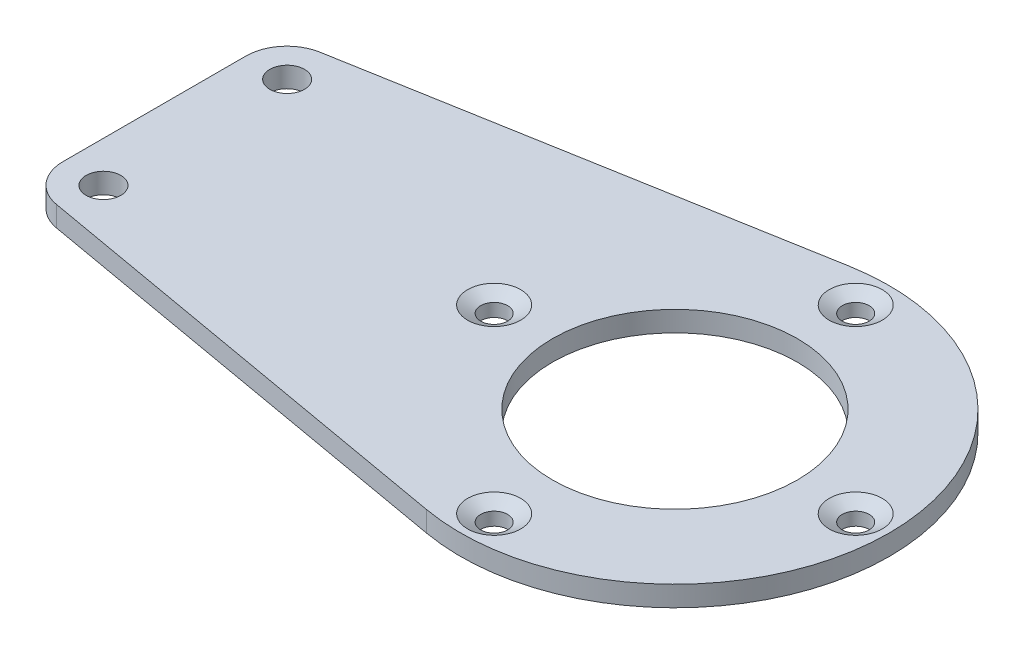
ISO-10303-21;
HEADER;
FILE_DESCRIPTION(('STEP AP214'),'2;1');
FILE_NAME('part.step','',(''),(''),'','','');
FILE_SCHEMA(('AUTOMOTIVE_DESIGN { 1 0 10303 214 1 1 1 1 }'));
ENDSEC;
DATA;
#1=APPLICATION_CONTEXT('core data for automotive mechanical design processes');
#2=APPLICATION_PROTOCOL_DEFINITION('international standard','automotive_design',2000,#1);
#3=PRODUCT_CONTEXT('',#1,'mechanical');
#4=PRODUCT('Part','Part','',(#3));
#5=PRODUCT_RELATED_PRODUCT_CATEGORY('part','',(#4));
#6=PRODUCT_DEFINITION_FORMATION('','',#4);
#7=PRODUCT_DEFINITION_CONTEXT('part definition',#1,'design');
#8=PRODUCT_DEFINITION('design','',#6,#7);
#9=PRODUCT_DEFINITION_SHAPE('','',#8);
#10=(LENGTH_UNIT() NAMED_UNIT(*) SI_UNIT(.MILLI.,.METRE.));
#11=(NAMED_UNIT(*) PLANE_ANGLE_UNIT() SI_UNIT($,.RADIAN.));
#12=(NAMED_UNIT(*) SI_UNIT($,.STERADIAN.) SOLID_ANGLE_UNIT());
#13=UNCERTAINTY_MEASURE_WITH_UNIT(LENGTH_MEASURE(1.E-05),#10,'distance_accuracy_value','');
#14=(GEOMETRIC_REPRESENTATION_CONTEXT(3) GLOBAL_UNCERTAINTY_ASSIGNED_CONTEXT((#13)) GLOBAL_UNIT_ASSIGNED_CONTEXT((#10,
#11,#12)) REPRESENTATION_CONTEXT('',''));
#15=CARTESIAN_POINT('',(0.,0.,0.));
#16=DIRECTION('',(0.,0.,1.));
#17=DIRECTION('',(1.,0.,0.));
#18=AXIS2_PLACEMENT_3D('',#15,#16,#17);
#19=CARTESIAN_POINT('',(0.,1.87583282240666E-09,-44.285));
#20=DIRECTION('',(0.,1.,0.));
#21=DIRECTION('',(0.,0.,1.));
#22=AXIS2_PLACEMENT_3D('',#19,#20,#21);
#23=CONICAL_SURFACE('',#22,6.49999999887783,1.05840686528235);
#24=CARTESIAN_POINT('',(0.,1.87583282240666E-09,-44.285));
#25=DIRECTION('',(0.,1.,0.));
#26=DIRECTION('',(0.,0.,1.));
#27=AXIS2_PLACEMENT_3D('',#24,#25,#26);
#28=CIRCLE('',#27,6.49999999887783);
#29=CARTESIAN_POINT('',(0.,1.87583282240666E-09,-37.7850000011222));
#30=VERTEX_POINT('',#29);
#31=EDGE_CURVE('E18',#30,#30,#28,.T.);
#32=ORIENTED_EDGE('',*,*,#31,.T.);
#33=EDGE_LOOP('',(#32));
#34=FACE_BOUND('',#33,.T.);
#35=CARTESIAN_POINT('',(0.,-1.80000000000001,-44.285));
#36=DIRECTION('',(0.,-1.,0.));
#37=DIRECTION('',(0.,0.,-1.));
#38=AXIS2_PLACEMENT_3D('',#35,#36,#37);
#39=CIRCLE('',#38,3.3);
#40=CARTESIAN_POINT('',(0.,-1.80000000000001,-47.585));
#41=VERTEX_POINT('',#40);
#42=EDGE_CURVE('E313',#41,#41,#39,.T.);
#43=ORIENTED_EDGE('',*,*,#42,.T.);
#44=EDGE_LOOP('',(#43));
#45=FACE_BOUND('',#44,.T.);
#46=ADVANCED_FACE('F15',(#34,#45),#23,.F.);
#47=CARTESIAN_POINT('',(44.285,1.87583282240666E-09,0.));
#48=DIRECTION('',(0.,1.,0.));
#49=DIRECTION('',(0.,0.,1.));
#50=AXIS2_PLACEMENT_3D('',#47,#48,#49);
#51=CONICAL_SURFACE('',#50,6.49999999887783,1.05840686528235);
#52=CARTESIAN_POINT('',(44.285,1.87583282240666E-09,0.));
#53=DIRECTION('',(0.,1.,0.));
#54=DIRECTION('',(0.,0.,1.));
#55=AXIS2_PLACEMENT_3D('',#52,#53,#54);
#56=CIRCLE('',#55,6.49999999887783);
#57=CARTESIAN_POINT('',(44.285,1.87583282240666E-09,6.49999999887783));
#58=VERTEX_POINT('',#57);
#59=EDGE_CURVE('E148',#58,#58,#56,.T.);
#60=ORIENTED_EDGE('',*,*,#59,.T.);
#61=EDGE_LOOP('',(#60));
#62=FACE_BOUND('',#61,.T.);
#63=CARTESIAN_POINT('',(44.285,-1.8,0.));
#64=DIRECTION('',(0.,-1.,0.));
#65=DIRECTION('',(0.,0.,-1.));
#66=AXIS2_PLACEMENT_3D('',#63,#64,#65);
#67=CIRCLE('',#66,3.3);
#68=CARTESIAN_POINT('',(44.285,-1.8,-3.29999999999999));
#69=VERTEX_POINT('',#68);
#70=EDGE_CURVE('E311',#69,#69,#67,.T.);
#71=ORIENTED_EDGE('',*,*,#70,.T.);
#72=EDGE_LOOP('',(#71));
#73=FACE_BOUND('',#72,.T.);
#74=ADVANCED_FACE('F294',(#62,#73),#51,.F.);
#75=CARTESIAN_POINT('',(0.,1.87583282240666E-09,44.285));
#76=DIRECTION('',(0.,1.,0.));
#77=DIRECTION('',(0.,0.,1.));
#78=AXIS2_PLACEMENT_3D('',#75,#76,#77);
#79=CONICAL_SURFACE('',#78,6.49999999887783,1.05840686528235);
#80=CARTESIAN_POINT('',(0.,1.87583282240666E-09,44.285));
#81=DIRECTION('',(0.,1.,0.));
#82=DIRECTION('',(0.,0.,1.));
#83=AXIS2_PLACEMENT_3D('',#80,#81,#82);
#84=CIRCLE('',#83,6.49999999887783);
#85=CARTESIAN_POINT('',(0.,1.87583282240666E-09,50.7849999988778));
#86=VERTEX_POINT('',#85);
#87=EDGE_CURVE('E146',#86,#86,#84,.T.);
#88=ORIENTED_EDGE('',*,*,#87,.T.);
#89=EDGE_LOOP('',(#88));
#90=FACE_BOUND('',#89,.T.);
#91=CARTESIAN_POINT('',(0.,-1.79999999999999,44.285));
#92=DIRECTION('',(0.,-1.,0.));
#93=DIRECTION('',(0.,0.,-1.));
#94=AXIS2_PLACEMENT_3D('',#91,#92,#93);
#95=CIRCLE('',#94,3.3);
#96=CARTESIAN_POINT('',(0.,-1.79999999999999,40.985));
#97=VERTEX_POINT('',#96);
#98=EDGE_CURVE('E312',#97,#97,#95,.T.);
#99=ORIENTED_EDGE('',*,*,#98,.T.);
#100=EDGE_LOOP('',(#99));
#101=FACE_BOUND('',#100,.T.);
#102=ADVANCED_FACE('F168',(#90,#101),#79,.F.);
#103=CARTESIAN_POINT('',(-44.285,1.87583282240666E-09,0.));
#104=DIRECTION('',(0.,1.,0.));
#105=DIRECTION('',(0.,0.,1.));
#106=AXIS2_PLACEMENT_3D('',#103,#104,#105);
#107=CONICAL_SURFACE('',#106,6.49999999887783,1.05840686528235);
#108=CARTESIAN_POINT('',(-44.285,1.87583282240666E-09,0.));
#109=DIRECTION('',(0.,1.,0.));
#110=DIRECTION('',(0.,0.,1.));
#111=AXIS2_PLACEMENT_3D('',#108,#109,#110);
#112=CIRCLE('',#111,6.49999999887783);
#113=CARTESIAN_POINT('',(-44.285,1.87583282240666E-09,6.49999999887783));
#114=VERTEX_POINT('',#113);
#115=EDGE_CURVE('E98',#114,#114,#112,.T.);
#116=ORIENTED_EDGE('',*,*,#115,.T.);
#117=EDGE_LOOP('',(#116));
#118=FACE_BOUND('',#117,.T.);
#119=CARTESIAN_POINT('',(-44.285,-1.8,0.));
#120=DIRECTION('',(0.,-1.,0.));
#121=DIRECTION('',(0.,0.,-1.));
#122=AXIS2_PLACEMENT_3D('',#119,#120,#121);
#123=CIRCLE('',#122,3.3);
#124=CARTESIAN_POINT('',(-44.285,-1.8,-3.3));
#125=VERTEX_POINT('',#124);
#126=EDGE_CURVE('E138',#125,#125,#123,.T.);
#127=ORIENTED_EDGE('',*,*,#126,.T.);
#128=EDGE_LOOP('',(#127));
#129=FACE_BOUND('',#128,.T.);
#130=ADVANCED_FACE('F159',(#118,#129),#107,.F.);
#131=CARTESIAN_POINT('',(-39.2237538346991,0.,0.));
#132=DIRECTION('',(0.,-1.,0.));
#133=DIRECTION('',(0.,0.,-1.));
#134=AXIS2_PLACEMENT_3D('',#131,#132,#133);
#135=PLANE('',#134);
#136=CARTESIAN_POINT('',(0.,0.,0.));
#137=DIRECTION('',(0.,1.,0.));
#138=DIRECTION('',(0.,0.,1.));
#139=AXIS2_PLACEMENT_3D('',#136,#137,#138);
#140=CIRCLE('',#139,30.);
#141=CARTESIAN_POINT('',(0.,0.,30.));
#142=VERTEX_POINT('',#141);
#143=EDGE_CURVE('E129',#142,#142,#140,.F.);
#144=ORIENTED_EDGE('',*,*,#143,.T.);
#145=EDGE_LOOP('',(#144));
#146=FACE_BOUND('',#145,.T.);
#147=CARTESIAN_POINT('',(-117.5,0.,-22.5));
#148=DIRECTION('',(0.,1.,0.));
#149=DIRECTION('',(0.,0.,1.));
#150=AXIS2_PLACEMENT_3D('',#147,#148,#149);
#151=CIRCLE('',#150,4.25);
#152=CARTESIAN_POINT('',(-117.5,0.,-18.25));
#153=VERTEX_POINT('',#152);
#154=EDGE_CURVE('E132',#153,#153,#151,.F.);
#155=ORIENTED_EDGE('',*,*,#154,.T.);
#156=EDGE_LOOP('',(#155));
#157=FACE_BOUND('',#156,.T.);
#158=CARTESIAN_POINT('',(-117.5,0.,22.5));
#159=DIRECTION('',(0.,1.,0.));
#160=DIRECTION('',(0.,0.,1.));
#161=AXIS2_PLACEMENT_3D('',#158,#159,#160);
#162=CIRCLE('',#161,4.25);
#163=CARTESIAN_POINT('',(-117.5,0.,26.75));
#164=VERTEX_POINT('',#163);
#165=EDGE_CURVE('E135',#164,#164,#162,.F.);
#166=ORIENTED_EDGE('',*,*,#165,.T.);
#167=EDGE_LOOP('',(#166));
#168=FACE_BOUND('',#167,.T.);
#169=ORIENTED_EDGE('',*,*,#115,.F.);
#170=EDGE_LOOP('',(#169));
#171=FACE_BOUND('',#170,.T.);
#172=ORIENTED_EDGE('',*,*,#87,.F.);
#173=EDGE_LOOP('',(#172));
#174=FACE_BOUND('',#173,.T.);
#175=ORIENTED_EDGE('',*,*,#59,.F.);
#176=EDGE_LOOP('',(#175));
#177=FACE_BOUND('',#176,.T.);
#178=ORIENTED_EDGE('',*,*,#31,.F.);
#179=EDGE_LOOP('',(#178));
#180=FACE_BOUND('',#179,.T.);
#181=DIRECTION('',(-0.984807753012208,0.,0.173648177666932));
#182=VECTOR('',#181,1.);
#183=CARTESIAN_POINT('',(-9.11652932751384,0.,-51.7024070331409));
#184=LINE('',#183,#182);
#185=CARTESIAN_POINT('',(-119.236481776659,0.,-32.2852883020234));
#186=VERTEX_POINT('',#185);
#187=CARTESIAN_POINT('',(-9.11652932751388,0.,-51.7024070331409));
#188=VERTEX_POINT('',#187);
#189=EDGE_CURVE('E64',#186,#188,#184,.F.);
#190=ORIENTED_EDGE('',*,*,#189,.F.);
#191=CARTESIAN_POINT('',(-117.49999999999,0.,-22.4372107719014));
#192=DIRECTION('',(0.,-1.,0.));
#193=DIRECTION('',(0.,0.,-1.));
#194=AXIS2_PLACEMENT_3D('',#191,#192,#193);
#195=CIRCLE('',#194,9.99999999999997);
#196=CARTESIAN_POINT('',(-127.49999999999,0.,-22.4372107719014));
#197=VERTEX_POINT('',#196);
#198=EDGE_CURVE('E139',#197,#186,#195,.T.);
#199=ORIENTED_EDGE('',*,*,#198,.F.);
#200=DIRECTION('',(0.,0.,1.));
#201=VECTOR('',#200,1.);
#202=CARTESIAN_POINT('',(-127.49999999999,0.,-22.4372107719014));
#203=LINE('',#202,#201);
#204=CARTESIAN_POINT('',(-127.49999999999,0.,22.4372107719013));
#205=VERTEX_POINT('',#204);
#206=EDGE_CURVE('E99',#205,#197,#203,.F.);
#207=ORIENTED_EDGE('',*,*,#206,.F.);
#208=CARTESIAN_POINT('',(-117.49999999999,0.,22.4372107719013));
#209=DIRECTION('',(0.,-1.,0.));
#210=DIRECTION('',(0.,0.,-1.));
#211=AXIS2_PLACEMENT_3D('',#208,#209,#210);
#212=CIRCLE('',#211,10.);
#213=CARTESIAN_POINT('',(-119.236481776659,0.,32.2852883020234));
#214=VERTEX_POINT('',#213);
#215=EDGE_CURVE('E83',#214,#205,#212,.T.);
#216=ORIENTED_EDGE('',*,*,#215,.F.);
#217=DIRECTION('',(0.984807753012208,0.,0.173648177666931));
#218=VECTOR('',#217,1.);
#219=CARTESIAN_POINT('',(-119.236481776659,0.,32.2852883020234));
#220=LINE('',#219,#218);
#221=CARTESIAN_POINT('',(-9.11652932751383,0.,51.7024070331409));
#222=VERTEX_POINT('',#221);
#223=EDGE_CURVE('E80',#222,#214,#220,.F.);
#224=ORIENTED_EDGE('',*,*,#223,.F.);
#225=CARTESIAN_POINT('',(0.,0.,0.));
#226=DIRECTION('',(0.,-1.,0.));
#227=DIRECTION('',(0.,0.,-1.));
#228=AXIS2_PLACEMENT_3D('',#225,#226,#227);
#229=CIRCLE('',#228,52.5);
#230=EDGE_CURVE('E69',#188,#222,#229,.T.);
#231=ORIENTED_EDGE('',*,*,#230,.F.);
#232=EDGE_LOOP('',(#190,#199,#207,#216,#224,#231));
#233=FACE_BOUND('',#232,.T.);
#234=ADVANCED_FACE('F81',(#146,#157,#168,#171,#174,#177,#180,#233),#135,.F.);
#235=CARTESIAN_POINT('',(-9.11652932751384,0.,-51.7024070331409));
#236=DIRECTION('',(-0.173648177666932,0.,-0.984807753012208));
#237=DIRECTION('',(-0.984807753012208,0.,0.173648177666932));
#238=AXIS2_PLACEMENT_3D('',#235,#236,#237);
#239=PLANE('',#238);
#240=ORIENTED_EDGE('',*,*,#189,.T.);
#241=DIRECTION('',(0.,-1.,0.));
#242=VECTOR('',#241,1.);
#243=CARTESIAN_POINT('',(-9.11652932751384,0.,-51.7024070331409));
#244=LINE('',#243,#242);
#245=CARTESIAN_POINT('',(-9.11652932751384,-5.,-51.7024070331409));
#246=VERTEX_POINT('',#245);
#247=EDGE_CURVE('E76',#246,#188,#244,.F.);
#248=ORIENTED_EDGE('',*,*,#247,.F.);
#249=DIRECTION('',(0.984807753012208,0.,-0.17364817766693));
#250=VECTOR('',#249,1.);
#251=CARTESIAN_POINT('',(-119.236481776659,-5.,-32.2852883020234));
#252=LINE('',#251,#250);
#253=CARTESIAN_POINT('',(-119.236481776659,-5.,-32.2852883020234));
#254=VERTEX_POINT('',#253);
#255=EDGE_CURVE('E128',#254,#246,#252,.T.);
#256=ORIENTED_EDGE('',*,*,#255,.F.);
#257=DIRECTION('',(0.,-1.,0.));
#258=VECTOR('',#257,1.);
#259=CARTESIAN_POINT('',(-119.236481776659,0.,-32.2852883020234));
#260=LINE('',#259,#258);
#261=EDGE_CURVE('E142',#186,#254,#260,.T.);
#262=ORIENTED_EDGE('',*,*,#261,.F.);
#263=EDGE_LOOP('',(#240,#248,#256,#262));
#264=FACE_BOUND('',#263,.T.);
#265=ADVANCED_FACE('F158',(#264),#239,.T.);
#266=CARTESIAN_POINT('',(0.,0.,0.));
#267=DIRECTION('',(0.,-1.,0.));
#268=DIRECTION('',(0.,0.,-1.));
#269=AXIS2_PLACEMENT_3D('',#266,#267,#268);
#270=CYLINDRICAL_SURFACE('',#269,52.5);
#271=ORIENTED_EDGE('',*,*,#230,.T.);
#272=DIRECTION('',(0.,1.,0.));
#273=VECTOR('',#272,1.);
#274=CARTESIAN_POINT('',(-9.11652932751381,0.,51.7024070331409));
#275=LINE('',#274,#273);
#276=CARTESIAN_POINT('',(-9.11652932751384,-5.,51.7024070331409));
#277=VERTEX_POINT('',#276);
#278=EDGE_CURVE('E74',#277,#222,#275,.T.);
#279=ORIENTED_EDGE('',*,*,#278,.F.);
#280=CARTESIAN_POINT('',(0.,-5.,0.));
#281=DIRECTION('',(0.,-1.,0.));
#282=DIRECTION('',(0.,0.,-1.));
#283=AXIS2_PLACEMENT_3D('',#280,#281,#282);
#284=CIRCLE('',#283,52.5);
#285=EDGE_CURVE('E126',#246,#277,#284,.T.);
#286=ORIENTED_EDGE('',*,*,#285,.F.);
#287=ORIENTED_EDGE('',*,*,#247,.T.);
#288=EDGE_LOOP('',(#271,#279,#286,#287));
#289=FACE_BOUND('',#288,.T.);
#290=ADVANCED_FACE('F71',(#289),#270,.T.);
#291=CARTESIAN_POINT('',(-119.236481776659,0.,32.2852883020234));
#292=DIRECTION('',(-0.173648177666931,0.,0.984807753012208));
#293=DIRECTION('',(0.984807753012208,0.,0.173648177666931));
#294=AXIS2_PLACEMENT_3D('',#291,#292,#293);
#295=PLANE('',#294);
#296=ORIENTED_EDGE('',*,*,#223,.T.);
#297=DIRECTION('',(0.,-1.,0.));
#298=VECTOR('',#297,1.);
#299=CARTESIAN_POINT('',(-119.236481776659,0.,32.2852883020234));
#300=LINE('',#299,#298);
#301=CARTESIAN_POINT('',(-119.236481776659,-5.,32.2852883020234));
#302=VERTEX_POINT('',#301);
#303=EDGE_CURVE('E86',#302,#214,#300,.F.);
#304=ORIENTED_EDGE('',*,*,#303,.F.);
#305=DIRECTION('',(-0.984807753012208,0.,-0.173648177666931));
#306=VECTOR('',#305,1.);
#307=CARTESIAN_POINT('',(-9.11652932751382,-5.,51.702407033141));
#308=LINE('',#307,#306);
#309=EDGE_CURVE('E90',#277,#302,#308,.T.);
#310=ORIENTED_EDGE('',*,*,#309,.F.);
#311=ORIENTED_EDGE('',*,*,#278,.T.);
#312=EDGE_LOOP('',(#296,#304,#310,#311));
#313=FACE_BOUND('',#312,.T.);
#314=ADVANCED_FACE('F88',(#313),#295,.T.);
#315=CARTESIAN_POINT('',(-117.49999999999,0.,22.4372107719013));
#316=DIRECTION('',(0.,-1.,0.));
#317=DIRECTION('',(0.,0.,-1.));
#318=AXIS2_PLACEMENT_3D('',#315,#316,#317);
#319=CYLINDRICAL_SURFACE('',#318,10.);
#320=ORIENTED_EDGE('',*,*,#215,.T.);
#321=DIRECTION('',(0.,1.,0.));
#322=VECTOR('',#321,1.);
#323=CARTESIAN_POINT('',(-127.49999999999,0.,22.4372107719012));
#324=LINE('',#323,#322);
#325=CARTESIAN_POINT('',(-127.49999999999,-5.,22.4372107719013));
#326=VERTEX_POINT('',#325);
#327=EDGE_CURVE('E100',#326,#205,#324,.T.);
#328=ORIENTED_EDGE('',*,*,#327,.F.);
#329=CARTESIAN_POINT('',(-117.49999999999,-5.,22.4372107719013));
#330=DIRECTION('',(0.,-1.,0.));
#331=DIRECTION('',(0.,0.,-1.));
#332=AXIS2_PLACEMENT_3D('',#329,#330,#331);
#333=CIRCLE('',#332,10.);
#334=EDGE_CURVE('E123',#302,#326,#333,.T.);
#335=ORIENTED_EDGE('',*,*,#334,.F.);
#336=ORIENTED_EDGE('',*,*,#303,.T.);
#337=EDGE_LOOP('',(#320,#328,#335,#336));
#338=FACE_BOUND('',#337,.T.);
#339=ADVANCED_FACE('F213',(#338),#319,.T.);
#340=CARTESIAN_POINT('',(-127.49999999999,0.,-22.4372107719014));
#341=DIRECTION('',(-1.,0.,0.));
#342=DIRECTION('',(0.,0.,1.));
#343=AXIS2_PLACEMENT_3D('',#340,#341,#342);
#344=PLANE('',#343);
#345=ORIENTED_EDGE('',*,*,#206,.T.);
#346=DIRECTION('',(0.,-1.,0.));
#347=VECTOR('',#346,1.);
#348=CARTESIAN_POINT('',(-127.49999999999,0.,-22.4372107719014));
#349=LINE('',#348,#347);
#350=CARTESIAN_POINT('',(-127.49999999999,-5.,-22.4372107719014));
#351=VERTEX_POINT('',#350);
#352=EDGE_CURVE('E33',#351,#197,#349,.F.);
#353=ORIENTED_EDGE('',*,*,#352,.F.);
#354=DIRECTION('',(0.,0.,-1.));
#355=VECTOR('',#354,1.);
#356=CARTESIAN_POINT('',(-127.49999999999,-5.,0.));
#357=LINE('',#356,#355);
#358=EDGE_CURVE('E122',#326,#351,#357,.T.);
#359=ORIENTED_EDGE('',*,*,#358,.F.);
#360=ORIENTED_EDGE('',*,*,#327,.T.);
#361=EDGE_LOOP('',(#345,#353,#359,#360));
#362=FACE_BOUND('',#361,.T.);
#363=ADVANCED_FACE('F209',(#362),#344,.T.);
#364=CARTESIAN_POINT('',(-117.49999999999,0.,-22.4372107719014));
#365=DIRECTION('',(0.,-1.,0.));
#366=DIRECTION('',(0.,0.,-1.));
#367=AXIS2_PLACEMENT_3D('',#364,#365,#366);
#368=CYLINDRICAL_SURFACE('',#367,9.99999999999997);
#369=ORIENTED_EDGE('',*,*,#198,.T.);
#370=ORIENTED_EDGE('',*,*,#261,.T.);
#371=CARTESIAN_POINT('',(-117.49999999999,-5.,-22.4372107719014));
#372=DIRECTION('',(0.,-1.,0.));
#373=DIRECTION('',(0.,0.,-1.));
#374=AXIS2_PLACEMENT_3D('',#371,#372,#373);
#375=CIRCLE('',#374,9.99999999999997);
#376=EDGE_CURVE('E119',#351,#254,#375,.T.);
#377=ORIENTED_EDGE('',*,*,#376,.F.);
#378=ORIENTED_EDGE('',*,*,#352,.T.);
#379=EDGE_LOOP('',(#369,#370,#377,#378));
#380=FACE_BOUND('',#379,.T.);
#381=ADVANCED_FACE('F205',(#380),#368,.T.);
#382=CARTESIAN_POINT('',(0.,-3.40000000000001,-44.285));
#383=DIRECTION('',(0.,-1.,0.));
#384=DIRECTION('',(0.,0.,-1.));
#385=AXIS2_PLACEMENT_3D('',#382,#383,#384);
#386=CYLINDRICAL_SURFACE('',#385,3.3);
#387=ORIENTED_EDGE('',*,*,#42,.F.);
#388=EDGE_LOOP('',(#387));
#389=FACE_BOUND('',#388,.T.);
#390=CARTESIAN_POINT('',(0.,-5.00000000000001,-44.285));
#391=DIRECTION('',(0.,-1.,0.));
#392=DIRECTION('',(0.,0.,-1.));
#393=AXIS2_PLACEMENT_3D('',#390,#391,#392);
#394=CIRCLE('',#393,3.3);
#395=CARTESIAN_POINT('',(0.,-5.00000000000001,-47.585));
#396=VERTEX_POINT('',#395);
#397=EDGE_CURVE('E116',#396,#396,#394,.F.);
#398=ORIENTED_EDGE('',*,*,#397,.F.);
#399=EDGE_LOOP('',(#398));
#400=FACE_BOUND('',#399,.T.);
#401=ADVANCED_FACE('F201',(#389,#400),#386,.F.);
#402=CARTESIAN_POINT('',(44.285,-3.4,0.));
#403=DIRECTION('',(0.,-1.,0.));
#404=DIRECTION('',(0.,0.,-1.));
#405=AXIS2_PLACEMENT_3D('',#402,#403,#404);
#406=CYLINDRICAL_SURFACE('',#405,3.3);
#407=ORIENTED_EDGE('',*,*,#70,.F.);
#408=EDGE_LOOP('',(#407));
#409=FACE_BOUND('',#408,.T.);
#410=CARTESIAN_POINT('',(44.285,-5.,0.));
#411=DIRECTION('',(0.,-1.,0.));
#412=DIRECTION('',(0.,0.,-1.));
#413=AXIS2_PLACEMENT_3D('',#410,#411,#412);
#414=CIRCLE('',#413,3.3);
#415=CARTESIAN_POINT('',(44.285,-5.,-3.29999999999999));
#416=VERTEX_POINT('',#415);
#417=EDGE_CURVE('E113',#416,#416,#414,.F.);
#418=ORIENTED_EDGE('',*,*,#417,.F.);
#419=EDGE_LOOP('',(#418));
#420=FACE_BOUND('',#419,.T.);
#421=ADVANCED_FACE('F197',(#409,#420),#406,.F.);
#422=CARTESIAN_POINT('',(0.,-3.39999999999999,44.285));
#423=DIRECTION('',(0.,-1.,0.));
#424=DIRECTION('',(0.,0.,-1.));
#425=AXIS2_PLACEMENT_3D('',#422,#423,#424);
#426=CYLINDRICAL_SURFACE('',#425,3.3);
#427=ORIENTED_EDGE('',*,*,#98,.F.);
#428=EDGE_LOOP('',(#427));
#429=FACE_BOUND('',#428,.T.);
#430=CARTESIAN_POINT('',(0.,-4.99999999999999,44.285));
#431=DIRECTION('',(0.,-1.,0.));
#432=DIRECTION('',(0.,0.,-1.));
#433=AXIS2_PLACEMENT_3D('',#430,#431,#432);
#434=CIRCLE('',#433,3.3);
#435=CARTESIAN_POINT('',(0.,-4.99999999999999,40.985));
#436=VERTEX_POINT('',#435);
#437=EDGE_CURVE('E110',#436,#436,#434,.F.);
#438=ORIENTED_EDGE('',*,*,#437,.F.);
#439=EDGE_LOOP('',(#438));
#440=FACE_BOUND('',#439,.T.);
#441=ADVANCED_FACE('F193',(#429,#440),#426,.F.);
#442=CARTESIAN_POINT('',(-44.285,-3.4,0.));
#443=DIRECTION('',(0.,-1.,0.));
#444=DIRECTION('',(0.,0.,-1.));
#445=AXIS2_PLACEMENT_3D('',#442,#443,#444);
#446=CYLINDRICAL_SURFACE('',#445,3.3);
#447=ORIENTED_EDGE('',*,*,#126,.F.);
#448=EDGE_LOOP('',(#447));
#449=FACE_BOUND('',#448,.T.);
#450=CARTESIAN_POINT('',(-44.285,-5.,0.));
#451=DIRECTION('',(0.,-1.,0.));
#452=DIRECTION('',(0.,0.,-1.));
#453=AXIS2_PLACEMENT_3D('',#450,#451,#452);
#454=CIRCLE('',#453,3.3);
#455=CARTESIAN_POINT('',(-44.285,-5.,-3.3));
#456=VERTEX_POINT('',#455);
#457=EDGE_CURVE('E107',#456,#456,#454,.F.);
#458=ORIENTED_EDGE('',*,*,#457,.F.);
#459=EDGE_LOOP('',(#458));
#460=FACE_BOUND('',#459,.T.);
#461=ADVANCED_FACE('F189',(#449,#460),#446,.F.);
#462=CARTESIAN_POINT('',(-117.5,-2.5,22.5));
#463=DIRECTION('',(0.,1.,0.));
#464=DIRECTION('',(0.,0.,1.));
#465=AXIS2_PLACEMENT_3D('',#462,#463,#464);
#466=CYLINDRICAL_SURFACE('',#465,4.25);
#467=CARTESIAN_POINT('',(-117.5,-5.,22.5));
#468=DIRECTION('',(0.,1.,0.));
#469=DIRECTION('',(0.,0.,1.));
#470=AXIS2_PLACEMENT_3D('',#467,#468,#469);
#471=CIRCLE('',#470,4.25);
#472=CARTESIAN_POINT('',(-117.5,-5.,26.75));
#473=VERTEX_POINT('',#472);
#474=EDGE_CURVE('E104',#473,#473,#471,.T.);
#475=ORIENTED_EDGE('',*,*,#474,.F.);
#476=EDGE_LOOP('',(#475));
#477=FACE_BOUND('',#476,.T.);
#478=ORIENTED_EDGE('',*,*,#165,.F.);
#479=EDGE_LOOP('',(#478));
#480=FACE_BOUND('',#479,.T.);
#481=ADVANCED_FACE('F185',(#477,#480),#466,.F.);
#482=CARTESIAN_POINT('',(-117.5,-2.5,-22.5));
#483=DIRECTION('',(0.,1.,0.));
#484=DIRECTION('',(0.,0.,1.));
#485=AXIS2_PLACEMENT_3D('',#482,#483,#484);
#486=CYLINDRICAL_SURFACE('',#485,4.25);
#487=CARTESIAN_POINT('',(-117.5,-5.,-22.5));
#488=DIRECTION('',(0.,1.,0.));
#489=DIRECTION('',(0.,0.,1.));
#490=AXIS2_PLACEMENT_3D('',#487,#488,#489);
#491=CIRCLE('',#490,4.25);
#492=CARTESIAN_POINT('',(-117.5,-5.,-18.25));
#493=VERTEX_POINT('',#492);
#494=EDGE_CURVE('E24',#493,#493,#491,.T.);
#495=ORIENTED_EDGE('',*,*,#494,.F.);
#496=EDGE_LOOP('',(#495));
#497=FACE_BOUND('',#496,.T.);
#498=ORIENTED_EDGE('',*,*,#154,.F.);
#499=EDGE_LOOP('',(#498));
#500=FACE_BOUND('',#499,.T.);
#501=ADVANCED_FACE('F178',(#497,#500),#486,.F.);
#502=CARTESIAN_POINT('',(0.,-2.5,0.));
#503=DIRECTION('',(0.,1.,0.));
#504=DIRECTION('',(0.,0.,1.));
#505=AXIS2_PLACEMENT_3D('',#502,#503,#504);
#506=CYLINDRICAL_SURFACE('',#505,30.);
#507=CARTESIAN_POINT('',(0.,-5.,0.));
#508=DIRECTION('',(0.,1.,0.));
#509=DIRECTION('',(0.,0.,1.));
#510=AXIS2_PLACEMENT_3D('',#507,#508,#509);
#511=CIRCLE('',#510,30.);
#512=CARTESIAN_POINT('',(0.,-5.,30.));
#513=VERTEX_POINT('',#512);
#514=EDGE_CURVE('E10',#513,#513,#511,.T.);
#515=ORIENTED_EDGE('',*,*,#514,.F.);
#516=EDGE_LOOP('',(#515));
#517=FACE_BOUND('',#516,.T.);
#518=ORIENTED_EDGE('',*,*,#143,.F.);
#519=EDGE_LOOP('',(#518));
#520=FACE_BOUND('',#519,.T.);
#521=ADVANCED_FACE('F173',(#517,#520),#506,.F.);
#522=CARTESIAN_POINT('',(-39.2237538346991,-5.,0.));
#523=DIRECTION('',(0.,-1.,0.));
#524=DIRECTION('',(0.,0.,-1.));
#525=AXIS2_PLACEMENT_3D('',#522,#523,#524);
#526=PLANE('',#525);
#527=ORIENTED_EDGE('',*,*,#514,.T.);
#528=EDGE_LOOP('',(#527));
#529=FACE_BOUND('',#528,.T.);
#530=ORIENTED_EDGE('',*,*,#494,.T.);
#531=EDGE_LOOP('',(#530));
#532=FACE_BOUND('',#531,.T.);
#533=ORIENTED_EDGE('',*,*,#474,.T.);
#534=EDGE_LOOP('',(#533));
#535=FACE_BOUND('',#534,.T.);
#536=ORIENTED_EDGE('',*,*,#457,.T.);
#537=EDGE_LOOP('',(#536));
#538=FACE_BOUND('',#537,.T.);
#539=ORIENTED_EDGE('',*,*,#437,.T.);
#540=EDGE_LOOP('',(#539));
#541=FACE_BOUND('',#540,.T.);
#542=ORIENTED_EDGE('',*,*,#417,.T.);
#543=EDGE_LOOP('',(#542));
#544=FACE_BOUND('',#543,.T.);
#545=ORIENTED_EDGE('',*,*,#397,.T.);
#546=EDGE_LOOP('',(#545));
#547=FACE_BOUND('',#546,.T.);
#548=ORIENTED_EDGE('',*,*,#358,.T.);
#549=ORIENTED_EDGE('',*,*,#376,.T.);
#550=ORIENTED_EDGE('',*,*,#255,.T.);
#551=ORIENTED_EDGE('',*,*,#285,.T.);
#552=ORIENTED_EDGE('',*,*,#309,.T.);
#553=ORIENTED_EDGE('',*,*,#334,.T.);
#554=EDGE_LOOP('',(#548,#549,#550,#551,#552,#553));
#555=FACE_BOUND('',#554,.T.);
#556=ADVANCED_FACE('F172',(#529,#532,#535,#538,#541,#544,#547,#555),#526,.T.);
#557=CLOSED_SHELL('',(#46,#74,#102,#130,#234,#265,#290,#314,#339,#363,#381,#401,#421,#441,#461,
#481,#501,#521,#556));
#558=MANIFOLD_SOLID_BREP('B1',#557);
#559=ADVANCED_BREP_SHAPE_REPRESENTATION('',(#18,#558),#14);
#560=SHAPE_DEFINITION_REPRESENTATION(#9,#559);
ENDSEC;
END-ISO-10303-21;
